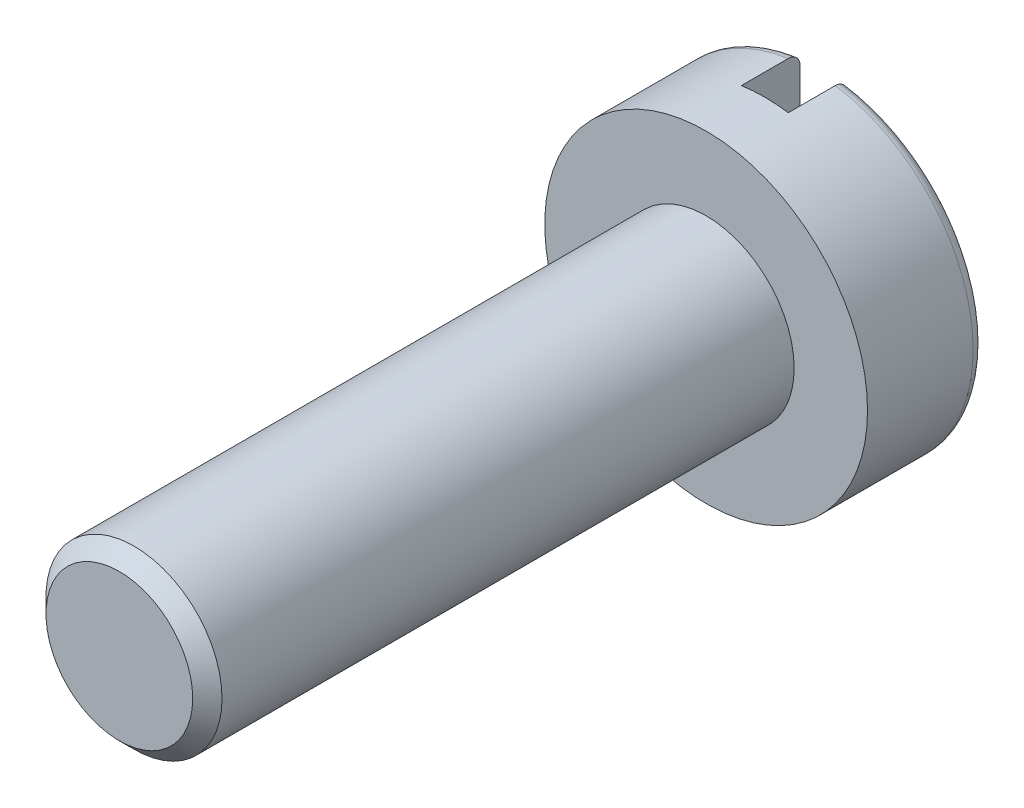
from build123d import *

# Parameters (mm, degrees)
ESQUISSE1_R             = 2.75
BASE_EXTRUSION_DEPTH    = 2
ESQUISSE2_R             = 1.5
BOSS_EXTRU_1_DEPTH      = 10
CHANFREIN1_SIZE         = 0.25
CONG_1_R                = 0.2
ESQUISSE3_W             = 0.8
ESQUISSE3_H             = 5.5
ENL_V_MAT_EXTRU_1_DEPTH = 1


with BuildPart() as part:
    # Esquisse1 → Base-Extrusion (new body)
    with BuildSketch(Plane.XY):
        Circle(ESQUISSE1_R)
    extrude(amount=-BASE_EXTRUSION_DEPTH)

    # Esquisse2 → Boss.-Extru.1 (add)
    with BuildSketch(Plane.XY):
        Circle(ESQUISSE2_R)
    extrude(amount=BOSS_EXTRU_1_DEPTH)

    # Chanfrein1
    chanfrein1_edges = [part.edges().sort_by_distance(p)[0] for p in [
        (-1.5, 0, 10),
    ]]
    chamfer(chanfrein1_edges, length=CHANFREIN1_SIZE)

    # Cong_1
    cong_1_edges = [part.edges().sort_by_distance(p)[0] for p in [
        (-2.75, 0, -2),
    ]]
    fillet(cong_1_edges, radius=CONG_1_R)

    # Esquisse3 → Enl_v. mat.-Extru.1 (cut)
    with BuildSketch(Plane(origin=(0, 0, -2), x_dir=(-1, 0, 0), z_dir=(0, 0, -1))):
        Rectangle(ESQUISSE3_W, ESQUISSE3_H)
    extrude(amount=-ENL_V_MAT_EXTRU_1_DEPTH, mode=Mode.SUBTRACT)


solid = part.part
